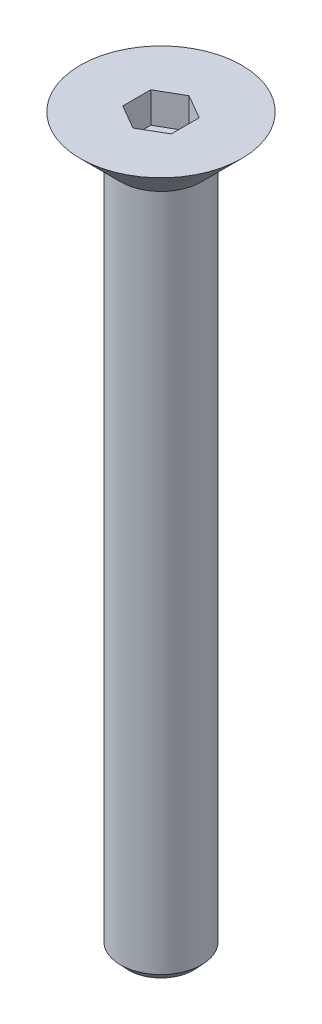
ISO-10303-21;
HEADER;
FILE_DESCRIPTION(('STEP AP214'),'2;1');
FILE_NAME('part.step','',(''),(''),'','','');
FILE_SCHEMA(('AUTOMOTIVE_DESIGN { 1 0 10303 214 1 1 1 1 }'));
ENDSEC;
DATA;
#1=APPLICATION_CONTEXT('core data for automotive mechanical design processes');
#2=APPLICATION_PROTOCOL_DEFINITION('international standard','automotive_design',2000,#1);
#3=PRODUCT_CONTEXT('',#1,'mechanical');
#4=PRODUCT('Part','Part','',(#3));
#5=PRODUCT_RELATED_PRODUCT_CATEGORY('part','',(#4));
#6=PRODUCT_DEFINITION_FORMATION('','',#4);
#7=PRODUCT_DEFINITION_CONTEXT('part definition',#1,'design');
#8=PRODUCT_DEFINITION('design','',#6,#7);
#9=PRODUCT_DEFINITION_SHAPE('','',#8);
#10=(LENGTH_UNIT() NAMED_UNIT(*) SI_UNIT(.MILLI.,.METRE.));
#11=(NAMED_UNIT(*) PLANE_ANGLE_UNIT() SI_UNIT($,.RADIAN.));
#12=(NAMED_UNIT(*) SI_UNIT($,.STERADIAN.) SOLID_ANGLE_UNIT());
#13=UNCERTAINTY_MEASURE_WITH_UNIT(LENGTH_MEASURE(1.E-05),#10,'distance_accuracy_value','');
#14=(GEOMETRIC_REPRESENTATION_CONTEXT(3) GLOBAL_UNCERTAINTY_ASSIGNED_CONTEXT((#13)) GLOBAL_UNIT_ASSIGNED_CONTEXT((#10,
#11,#12)) REPRESENTATION_CONTEXT('',''));
#15=CARTESIAN_POINT('',(0.,0.,0.));
#16=DIRECTION('',(0.,0.,1.));
#17=DIRECTION('',(1.,0.,0.));
#18=AXIS2_PLACEMENT_3D('',#15,#16,#17);
#19=CARTESIAN_POINT('',(-1.5,-1.90000000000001,0.866025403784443));
#20=DIRECTION('',(-1.,0.,0.));
#21=DIRECTION('',(0.,0.,1.));
#22=AXIS2_PLACEMENT_3D('',#19,#20,#21);
#23=PLANE('',#22);
#24=DIRECTION('',(0.,1.,0.));
#25=VECTOR('',#24,1.);
#26=CARTESIAN_POINT('',(-1.5,-1.90000000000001,0.866025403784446));
#27=LINE('',#26,#25);
#28=CARTESIAN_POINT('',(-1.5,0.,0.866025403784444));
#29=VERTEX_POINT('',#28);
#30=CARTESIAN_POINT('',(-1.5,-1.90000000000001,0.866025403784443));
#31=VERTEX_POINT('',#30);
#32=EDGE_CURVE('E83',#29,#31,#27,.F.);
#33=ORIENTED_EDGE('',*,*,#32,.T.);
#34=DIRECTION('',(0.,0.,1.));
#35=VECTOR('',#34,1.);
#36=CARTESIAN_POINT('',(-1.5,-1.90000000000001,0.866025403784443));
#37=LINE('',#36,#35);
#38=CARTESIAN_POINT('',(-1.5,-1.90000000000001,-0.866025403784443));
#39=VERTEX_POINT('',#38);
#40=EDGE_CURVE('E72',#39,#31,#37,.T.);
#41=ORIENTED_EDGE('',*,*,#40,.F.);
#42=DIRECTION('',(0.,1.,0.));
#43=VECTOR('',#42,1.);
#44=CARTESIAN_POINT('',(-1.5,-1.90000000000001,-0.866025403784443));
#45=LINE('',#44,#43);
#46=CARTESIAN_POINT('',(-1.5,0.,-0.866025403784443));
#47=VERTEX_POINT('',#46);
#48=EDGE_CURVE('E92',#39,#47,#45,.T.);
#49=ORIENTED_EDGE('',*,*,#48,.T.);
#50=DIRECTION('',(0.,0.,1.));
#51=VECTOR('',#50,1.);
#52=CARTESIAN_POINT('',(-1.5,0.,0.866025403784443));
#53=LINE('',#52,#51);
#54=EDGE_CURVE('E67',#29,#47,#53,.F.);
#55=ORIENTED_EDGE('',*,*,#54,.F.);
#56=EDGE_LOOP('',(#33,#41,#49,#55));
#57=FACE_BOUND('',#56,.T.);
#58=ADVANCED_FACE('F17',(#57),#23,.F.);
#59=CARTESIAN_POINT('',(0.,-1.90000000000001,1.73205080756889));
#60=DIRECTION('',(-0.5,0.,0.866025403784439));
#61=DIRECTION('',(0.866025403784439,0.,0.5));
#62=AXIS2_PLACEMENT_3D('',#59,#60,#61);
#63=PLANE('',#62);
#64=DIRECTION('',(0.,1.,0.));
#65=VECTOR('',#64,1.);
#66=CARTESIAN_POINT('',(0.,-1.90000000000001,1.73205080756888));
#67=LINE('',#66,#65);
#68=CARTESIAN_POINT('',(0.,0.,1.73205080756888));
#69=VERTEX_POINT('',#68);
#70=CARTESIAN_POINT('',(0.,-1.90000000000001,1.73205080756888));
#71=VERTEX_POINT('',#70);
#72=EDGE_CURVE('E88',#69,#71,#67,.F.);
#73=ORIENTED_EDGE('',*,*,#72,.T.);
#74=DIRECTION('',(0.866025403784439,0.,0.5));
#75=VECTOR('',#74,1.);
#76=CARTESIAN_POINT('',(0.,-1.90000000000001,1.73205080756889));
#77=LINE('',#76,#75);
#78=EDGE_CURVE('E76',#31,#71,#77,.T.);
#79=ORIENTED_EDGE('',*,*,#78,.F.);
#80=ORIENTED_EDGE('',*,*,#32,.F.);
#81=DIRECTION('',(0.866025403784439,0.,0.5));
#82=VECTOR('',#81,1.);
#83=CARTESIAN_POINT('',(0.,0.,1.73205080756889));
#84=LINE('',#83,#82);
#85=EDGE_CURVE('E90',#69,#29,#84,.F.);
#86=ORIENTED_EDGE('',*,*,#85,.F.);
#87=EDGE_LOOP('',(#73,#79,#80,#86));
#88=FACE_BOUND('',#87,.T.);
#89=ADVANCED_FACE('F86',(#88),#63,.F.);
#90=CARTESIAN_POINT('',(-1.5,-1.90000000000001,-0.866025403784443));
#91=DIRECTION('',(-0.5,0.,-0.866025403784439));
#92=DIRECTION('',(-0.866025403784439,0.,0.5));
#93=AXIS2_PLACEMENT_3D('',#90,#91,#92);
#94=PLANE('',#93);
#95=ORIENTED_EDGE('',*,*,#48,.F.);
#96=DIRECTION('',(0.866025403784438,0.,-0.500000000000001));
#97=VECTOR('',#96,1.);
#98=CARTESIAN_POINT('',(-1.5,-1.90000000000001,-0.866025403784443));
#99=LINE('',#98,#97);
#100=CARTESIAN_POINT('',(0.,-1.90000000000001,-1.73205080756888));
#101=VERTEX_POINT('',#100);
#102=EDGE_CURVE('E79',#39,#101,#99,.T.);
#103=ORIENTED_EDGE('',*,*,#102,.T.);
#104=DIRECTION('',(0.,1.,0.));
#105=VECTOR('',#104,1.);
#106=CARTESIAN_POINT('',(0.,-1.90000000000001,-1.73205080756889));
#107=LINE('',#106,#105);
#108=CARTESIAN_POINT('',(0.,0.,-1.73205080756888));
#109=VERTEX_POINT('',#108);
#110=EDGE_CURVE('E117',#101,#109,#107,.T.);
#111=ORIENTED_EDGE('',*,*,#110,.T.);
#112=DIRECTION('',(-0.866025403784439,0.,0.5));
#113=VECTOR('',#112,1.);
#114=CARTESIAN_POINT('',(-1.5,0.,-0.866025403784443));
#115=LINE('',#114,#113);
#116=EDGE_CURVE('E128',#47,#109,#115,.F.);
#117=ORIENTED_EDGE('',*,*,#116,.F.);
#118=EDGE_LOOP('',(#95,#103,#111,#117));
#119=FACE_BOUND('',#118,.T.);
#120=ADVANCED_FACE('F131',(#119),#94,.F.);
#121=CARTESIAN_POINT('',(1.5,-1.90000000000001,0.866025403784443));
#122=DIRECTION('',(0.5,0.,0.866025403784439));
#123=DIRECTION('',(0.866025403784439,0.,-0.5));
#124=AXIS2_PLACEMENT_3D('',#121,#122,#123);
#125=PLANE('',#124);
#126=DIRECTION('',(0.,1.,0.));
#127=VECTOR('',#126,1.);
#128=CARTESIAN_POINT('',(1.5,-1.90000000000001,0.866025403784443));
#129=LINE('',#128,#127);
#130=CARTESIAN_POINT('',(1.5,0.,0.866025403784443));
#131=VERTEX_POINT('',#130);
#132=CARTESIAN_POINT('',(1.5,-1.90000000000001,0.866025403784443));
#133=VERTEX_POINT('',#132);
#134=EDGE_CURVE('E114',#131,#133,#129,.F.);
#135=ORIENTED_EDGE('',*,*,#134,.T.);
#136=DIRECTION('',(-0.866025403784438,0.,0.500000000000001));
#137=VECTOR('',#136,1.);
#138=CARTESIAN_POINT('',(1.5,-1.90000000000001,0.866025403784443));
#139=LINE('',#138,#137);
#140=EDGE_CURVE('E122',#133,#71,#139,.T.);
#141=ORIENTED_EDGE('',*,*,#140,.T.);
#142=ORIENTED_EDGE('',*,*,#72,.F.);
#143=DIRECTION('',(0.866025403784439,0.,-0.5));
#144=VECTOR('',#143,1.);
#145=CARTESIAN_POINT('',(1.5,0.,0.866025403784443));
#146=LINE('',#145,#144);
#147=EDGE_CURVE('E125',#131,#69,#146,.F.);
#148=ORIENTED_EDGE('',*,*,#147,.F.);
#149=EDGE_LOOP('',(#135,#141,#142,#148));
#150=FACE_BOUND('',#149,.T.);
#151=ADVANCED_FACE('F136',(#150),#125,.F.);
#152=CARTESIAN_POINT('',(0.,-1.90000000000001,1.73205080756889));
#153=DIRECTION('',(0.,-1.,0.));
#154=DIRECTION('',(0.,0.,-1.));
#155=AXIS2_PLACEMENT_3D('',#152,#153,#154);
#156=PLANE('',#155);
#157=DIRECTION('',(0.,0.,-1.));
#158=VECTOR('',#157,1.);
#159=CARTESIAN_POINT('',(1.5,-1.90000000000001,-0.866025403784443));
#160=LINE('',#159,#158);
#161=CARTESIAN_POINT('',(1.5,-1.90000000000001,-0.866025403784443));
#162=VERTEX_POINT('',#161);
#163=EDGE_CURVE('E110',#133,#162,#160,.T.);
#164=ORIENTED_EDGE('',*,*,#163,.T.);
#165=DIRECTION('',(-0.866025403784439,0.,-0.5));
#166=VECTOR('',#165,1.);
#167=CARTESIAN_POINT('',(0.,-1.90000000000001,-1.73205080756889));
#168=LINE('',#167,#166);
#169=EDGE_CURVE('E120',#162,#101,#168,.T.);
#170=ORIENTED_EDGE('',*,*,#169,.T.);
#171=ORIENTED_EDGE('',*,*,#102,.F.);
#172=ORIENTED_EDGE('',*,*,#40,.T.);
#173=ORIENTED_EDGE('',*,*,#78,.T.);
#174=ORIENTED_EDGE('',*,*,#140,.F.);
#175=EDGE_LOOP('',(#164,#170,#171,#172,#173,#174));
#176=FACE_BOUND('',#175,.T.);
#177=ADVANCED_FACE('F73',(#176),#156,.F.);
#178=CARTESIAN_POINT('',(0.,-1.90000000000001,-1.73205080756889));
#179=DIRECTION('',(0.5,0.,-0.866025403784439));
#180=DIRECTION('',(-0.866025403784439,0.,-0.5));
#181=AXIS2_PLACEMENT_3D('',#178,#179,#180);
#182=PLANE('',#181);
#183=ORIENTED_EDGE('',*,*,#110,.F.);
#184=ORIENTED_EDGE('',*,*,#169,.F.);
#185=DIRECTION('',(0.,1.,0.));
#186=VECTOR('',#185,1.);
#187=CARTESIAN_POINT('',(1.5,-1.90000000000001,-0.866025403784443));
#188=LINE('',#187,#186);
#189=CARTESIAN_POINT('',(1.5,0.,-0.866025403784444));
#190=VERTEX_POINT('',#189);
#191=EDGE_CURVE('E106',#162,#190,#188,.T.);
#192=ORIENTED_EDGE('',*,*,#191,.T.);
#193=DIRECTION('',(-0.866025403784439,0.,-0.5));
#194=VECTOR('',#193,1.);
#195=CARTESIAN_POINT('',(0.,0.,-1.73205080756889));
#196=LINE('',#195,#194);
#197=EDGE_CURVE('E35',#109,#190,#196,.F.);
#198=ORIENTED_EDGE('',*,*,#197,.F.);
#199=EDGE_LOOP('',(#183,#184,#192,#198));
#200=FACE_BOUND('',#199,.T.);
#201=ADVANCED_FACE('F143',(#200),#182,.F.);
#202=CARTESIAN_POINT('',(1.5,-1.90000000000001,-0.866025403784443));
#203=DIRECTION('',(1.,0.,0.));
#204=DIRECTION('',(0.,0.,-1.));
#205=AXIS2_PLACEMENT_3D('',#202,#203,#204);
#206=PLANE('',#205);
#207=ORIENTED_EDGE('',*,*,#191,.F.);
#208=ORIENTED_EDGE('',*,*,#163,.F.);
#209=ORIENTED_EDGE('',*,*,#134,.F.);
#210=DIRECTION('',(0.,0.,1.));
#211=VECTOR('',#210,1.);
#212=CARTESIAN_POINT('',(1.5,0.,0.));
#213=LINE('',#212,#211);
#214=EDGE_CURVE('E103',#190,#131,#213,.T.);
#215=ORIENTED_EDGE('',*,*,#214,.F.);
#216=EDGE_LOOP('',(#207,#208,#209,#215));
#217=FACE_BOUND('',#216,.T.);
#218=ADVANCED_FACE('F141',(#217),#206,.F.);
#219=CARTESIAN_POINT('',(0.,-44.9999999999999,0.));
#220=DIRECTION('',(0.,1.,0.));
#221=DIRECTION('',(0.,0.,1.));
#222=AXIS2_PLACEMENT_3D('',#219,#220,#221);
#223=PLANE('',#222);
#224=CARTESIAN_POINT('',(0.,-44.9999999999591,0.));
#225=DIRECTION('',(0.,1.,0.));
#226=DIRECTION('',(0.,0.,1.));
#227=AXIS2_PLACEMENT_3D('',#224,#225,#226);
#228=CIRCLE('',#227,2.00000000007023);
#229=CARTESIAN_POINT('',(0.,-44.9999999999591,2.00000000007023));
#230=VERTEX_POINT('',#229);
#231=EDGE_CURVE('E20',#230,#230,#228,.T.);
#232=ORIENTED_EDGE('',*,*,#231,.F.);
#233=EDGE_LOOP('',(#232));
#234=FACE_BOUND('',#233,.T.);
#235=ADVANCED_FACE('F151',(#234),#223,.F.);
#236=CARTESIAN_POINT('',(0.,0.,0.));
#237=DIRECTION('',(0.,1.,0.));
#238=DIRECTION('',(0.,0.,1.));
#239=AXIS2_PLACEMENT_3D('',#236,#237,#238);
#240=PLANE('',#239);
#241=CARTESIAN_POINT('',(0.,5.6843418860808E-11,0.));
#242=DIRECTION('',(0.,1.,0.));
#243=DIRECTION('',(0.,0.,1.));
#244=AXIS2_PLACEMENT_3D('',#241,#242,#243);
#245=CIRCLE('',#244,4.99999999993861);
#246=CARTESIAN_POINT('',(0.,5.6843418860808E-11,4.99999999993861));
#247=VERTEX_POINT('',#246);
#248=EDGE_CURVE('E96',#247,#247,#245,.F.);
#249=ORIENTED_EDGE('',*,*,#248,.F.);
#250=EDGE_LOOP('',(#249));
#251=FACE_BOUND('',#250,.T.);
#252=ORIENTED_EDGE('',*,*,#197,.T.);
#253=ORIENTED_EDGE('',*,*,#214,.T.);
#254=ORIENTED_EDGE('',*,*,#147,.T.);
#255=ORIENTED_EDGE('',*,*,#85,.T.);
#256=ORIENTED_EDGE('',*,*,#54,.T.);
#257=ORIENTED_EDGE('',*,*,#116,.T.);
#258=EDGE_LOOP('',(#252,#253,#254,#255,#256,#257));
#259=FACE_BOUND('',#258,.T.);
#260=ADVANCED_FACE('F133',(#251,#259),#240,.T.);
#261=CARTESIAN_POINT('',(0.,-44.4638156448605,0.));
#262=DIRECTION('',(0.,1.,0.));
#263=DIRECTION('',(0.,0.,1.));
#264=AXIS2_PLACEMENT_3D('',#261,#262,#263);
#265=CONICAL_SURFACE('',#264,2.50000000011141,0.750491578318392);
#266=CARTESIAN_POINT('',(0.,-44.4638156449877,0.));
#267=DIRECTION('',(0.,1.,0.));
#268=DIRECTION('',(0.,0.,1.));
#269=AXIS2_PLACEMENT_3D('',#266,#267,#268);
#270=CIRCLE('',#269,2.5);
#271=CARTESIAN_POINT('',(0.,-44.4638156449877,2.5));
#272=VERTEX_POINT('',#271);
#273=EDGE_CURVE('E26',#272,#272,#270,.T.);
#274=ORIENTED_EDGE('',*,*,#273,.F.);
#275=EDGE_LOOP('',(#274));
#276=FACE_BOUND('',#275,.T.);
#277=ORIENTED_EDGE('',*,*,#231,.T.);
#278=EDGE_LOOP('',(#277));
#279=FACE_BOUND('',#278,.T.);
#280=ADVANCED_FACE('F162',(#276,#279),#265,.T.);
#281=CARTESIAN_POINT('',(0.,5.6843418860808E-11,0.));
#282=DIRECTION('',(0.,1.,0.));
#283=DIRECTION('',(0.,0.,1.));
#284=AXIS2_PLACEMENT_3D('',#281,#282,#283);
#285=CONICAL_SURFACE('',#284,4.99999999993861,0.78539816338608);
#286=ORIENTED_EDGE('',*,*,#248,.T.);
#287=EDGE_LOOP('',(#286));
#288=FACE_BOUND('',#287,.T.);
#289=CARTESIAN_POINT('',(0.,-2.49999999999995,0.));
#290=DIRECTION('',(0.,1.,0.));
#291=DIRECTION('',(0.,0.,1.));
#292=AXIS2_PLACEMENT_3D('',#289,#290,#291);
#293=CIRCLE('',#292,2.5);
#294=CARTESIAN_POINT('',(0.,-2.49999999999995,2.5));
#295=VERTEX_POINT('',#294);
#296=EDGE_CURVE('E11',#295,#295,#293,.F.);
#297=ORIENTED_EDGE('',*,*,#296,.F.);
#298=EDGE_LOOP('',(#297));
#299=FACE_BOUND('',#298,.T.);
#300=ADVANCED_FACE('F156',(#288,#299),#285,.T.);
#301=CARTESIAN_POINT('',(0.,-44.9999999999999,0.));
#302=DIRECTION('',(0.,1.,0.));
#303=DIRECTION('',(0.,0.,1.));
#304=AXIS2_PLACEMENT_3D('',#301,#302,#303);
#305=CYLINDRICAL_SURFACE('',#304,2.5);
#306=ORIENTED_EDGE('',*,*,#296,.T.);
#307=EDGE_LOOP('',(#306));
#308=FACE_BOUND('',#307,.T.);
#309=ORIENTED_EDGE('',*,*,#273,.T.);
#310=EDGE_LOOP('',(#309));
#311=FACE_BOUND('',#310,.T.);
#312=ADVANCED_FACE('F154',(#308,#311),#305,.T.);
#313=CLOSED_SHELL('',(#58,#89,#120,#151,#177,#201,#218,#235,#260,#280,#300,#312));
#314=MANIFOLD_SOLID_BREP('B1',#313);
#315=ADVANCED_BREP_SHAPE_REPRESENTATION('',(#18,#314),#14);
#316=SHAPE_DEFINITION_REPRESENTATION(#9,#315);
ENDSEC;
END-ISO-10303-21;
